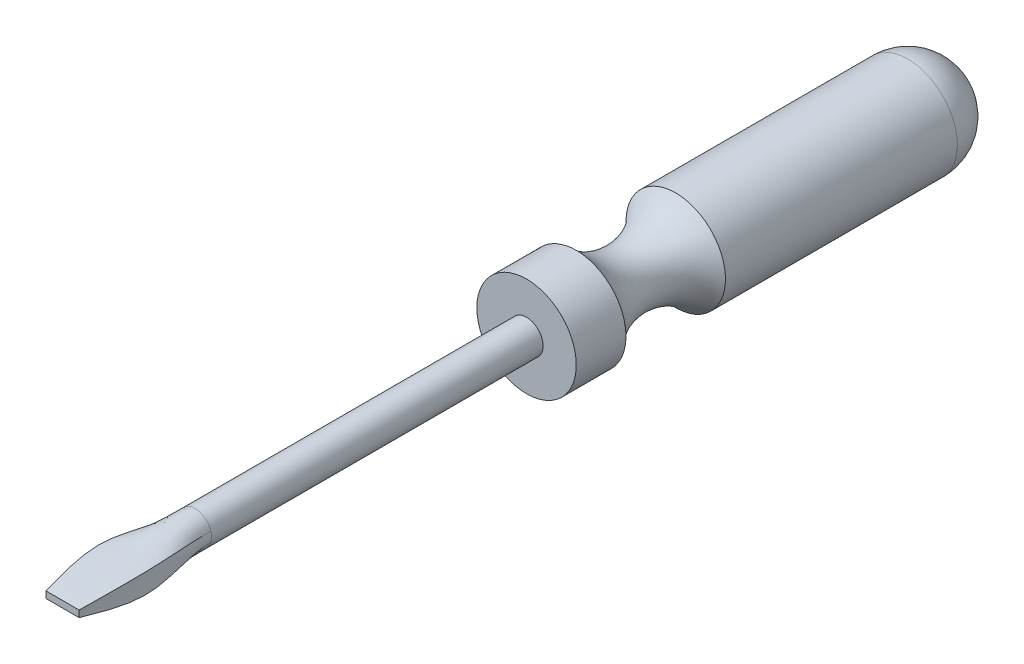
ISO-10303-21;
HEADER;
FILE_DESCRIPTION(('STEP AP214'),'2;1');
FILE_NAME('part.step','',(''),(''),'','','');
FILE_SCHEMA(('AUTOMOTIVE_DESIGN { 1 0 10303 214 1 1 1 1 }'));
ENDSEC;
DATA;
#1=APPLICATION_CONTEXT('core data for automotive mechanical design processes');
#2=APPLICATION_PROTOCOL_DEFINITION('international standard','automotive_design',2000,#1);
#3=PRODUCT_CONTEXT('',#1,'mechanical');
#4=PRODUCT('Part','Part','',(#3));
#5=PRODUCT_RELATED_PRODUCT_CATEGORY('part','',(#4));
#6=PRODUCT_DEFINITION_FORMATION('','',#4);
#7=PRODUCT_DEFINITION_CONTEXT('part definition',#1,'design');
#8=PRODUCT_DEFINITION('design','',#6,#7);
#9=PRODUCT_DEFINITION_SHAPE('','',#8);
#10=(LENGTH_UNIT() NAMED_UNIT(*) SI_UNIT(.MILLI.,.METRE.));
#11=(NAMED_UNIT(*) PLANE_ANGLE_UNIT() SI_UNIT($,.RADIAN.));
#12=(NAMED_UNIT(*) SI_UNIT($,.STERADIAN.) SOLID_ANGLE_UNIT());
#13=UNCERTAINTY_MEASURE_WITH_UNIT(LENGTH_MEASURE(1.E-05),#10,'distance_accuracy_value','');
#14=(GEOMETRIC_REPRESENTATION_CONTEXT(3) GLOBAL_UNCERTAINTY_ASSIGNED_CONTEXT((#13)) GLOBAL_UNIT_ASSIGNED_CONTEXT((#10,
#11,#12)) REPRESENTATION_CONTEXT('',''));
#15=CARTESIAN_POINT('',(0.,0.,0.));
#16=DIRECTION('',(0.,0.,1.));
#17=DIRECTION('',(1.,0.,0.));
#18=AXIS2_PLACEMENT_3D('',#15,#16,#17);
#19=CARTESIAN_POINT('',(0.,0.,0.));
#20=DIRECTION('',(0.,0.,-1.));
#21=DIRECTION('',(-1.,0.,0.));
#22=AXIS2_PLACEMENT_3D('',#19,#20,#21);
#23=PLANE('',#22);
#24=CARTESIAN_POINT('',(0.,0.,0.));
#25=DIRECTION('',(0.,0.,-1.));
#26=DIRECTION('',(-1.,0.,0.));
#27=AXIS2_PLACEMENT_3D('',#24,#25,#26);
#28=CIRCLE('',#27,19.05);
#29=CARTESIAN_POINT('',(-19.05,0.,0.));
#30=VERTEX_POINT('',#29);
#31=EDGE_CURVE('E60',#30,#30,#28,.T.);
#32=ORIENTED_EDGE('',*,*,#31,.F.);
#33=EDGE_LOOP('',(#32));
#34=FACE_BOUND('',#33,.T.);
#35=CARTESIAN_POINT('',(0.,0.,0.));
#36=DIRECTION('',(0.,0.,-1.));
#37=DIRECTION('',(-1.,0.,0.));
#38=AXIS2_PLACEMENT_3D('',#35,#36,#37);
#39=CIRCLE('',#38,6.35);
#40=CARTESIAN_POINT('',(-6.35,0.,0.));
#41=VERTEX_POINT('',#40);
#42=EDGE_CURVE('E12',#41,#41,#39,.F.);
#43=ORIENTED_EDGE('',*,*,#42,.F.);
#44=EDGE_LOOP('',(#43));
#45=FACE_BOUND('',#44,.T.);
#46=ADVANCED_FACE('F50',(#34,#45),#23,.F.);
#47=CARTESIAN_POINT('',(0.,0.,0.));
#48=DIRECTION('',(0.,0.,-1.));
#49=DIRECTION('',(-1.,0.,0.));
#50=AXIS2_PLACEMENT_3D('',#47,#48,#49);
#51=CYLINDRICAL_SURFACE('',#50,19.05);
#52=CARTESIAN_POINT('',(0.,0.,-19.05));
#53=DIRECTION('',(0.,0.,-1.));
#54=DIRECTION('',(-1.,0.,0.));
#55=AXIS2_PLACEMENT_3D('',#52,#53,#54);
#56=CIRCLE('',#55,19.05);
#57=CARTESIAN_POINT('',(-19.05,0.,-19.05));
#58=VERTEX_POINT('',#57);
#59=EDGE_CURVE('E165',#58,#58,#56,.T.);
#60=ORIENTED_EDGE('',*,*,#59,.F.);
#61=EDGE_LOOP('',(#60));
#62=FACE_BOUND('',#61,.T.);
#63=ORIENTED_EDGE('',*,*,#31,.T.);
#64=EDGE_LOOP('',(#63));
#65=FACE_BOUND('',#64,.T.);
#66=ADVANCED_FACE('F175',(#62,#65),#51,.T.);
#67=CARTESIAN_POINT('',(0.,0.,-38.1));
#68=DIRECTION('',(0.,0.,-1.));
#69=DIRECTION('',(-1.,0.,0.));
#70=AXIS2_PLACEMENT_3D('',#67,#68,#69);
#71=TOROIDAL_SURFACE('',#70,35.8505208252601,25.4);
#72=CARTESIAN_POINT('',(0.,0.,-57.15));
#73=DIRECTION('',(0.,0.,-1.));
#74=DIRECTION('',(-1.,0.,0.));
#75=AXIS2_PLACEMENT_3D('',#72,#73,#74);
#76=CIRCLE('',#75,19.05);
#77=CARTESIAN_POINT('',(-19.05,0.,-57.15));
#78=VERTEX_POINT('',#77);
#79=EDGE_CURVE('E160',#78,#78,#76,.T.);
#80=ORIENTED_EDGE('',*,*,#79,.F.);
#81=EDGE_LOOP('',(#80));
#82=FACE_BOUND('',#81,.T.);
#83=ORIENTED_EDGE('',*,*,#59,.T.);
#84=EDGE_LOOP('',(#83));
#85=FACE_BOUND('',#84,.T.);
#86=ADVANCED_FACE('F172',(#82,#85),#71,.F.);
#87=CARTESIAN_POINT('',(0.,0.,0.));
#88=DIRECTION('',(0.,0.,-1.));
#89=DIRECTION('',(-1.,0.,0.));
#90=AXIS2_PLACEMENT_3D('',#87,#88,#89);
#91=CYLINDRICAL_SURFACE('',#90,19.05);
#92=CARTESIAN_POINT('',(0.,0.,-146.05));
#93=DIRECTION('',(0.,0.,-1.));
#94=DIRECTION('',(-1.,0.,0.));
#95=AXIS2_PLACEMENT_3D('',#92,#93,#94);
#96=CIRCLE('',#95,19.05);
#97=CARTESIAN_POINT('',(-19.05,0.,-146.05));
#98=VERTEX_POINT('',#97);
#99=EDGE_CURVE('E121',#98,#98,#96,.T.);
#100=ORIENTED_EDGE('',*,*,#99,.F.);
#101=EDGE_LOOP('',(#100));
#102=FACE_BOUND('',#101,.T.);
#103=ORIENTED_EDGE('',*,*,#79,.T.);
#104=EDGE_LOOP('',(#103));
#105=FACE_BOUND('',#104,.T.);
#106=ADVANCED_FACE('F170',(#102,#105),#91,.T.);
#107=CARTESIAN_POINT('',(0.,0.,-146.05));
#108=DIRECTION('',(0.,0.,-1.));
#109=DIRECTION('',(1.,0.,0.));
#110=AXIS2_PLACEMENT_3D('',#107,#108,#109);
#111=SPHERICAL_SURFACE('',#110,19.05);
#112=ORIENTED_EDGE('',*,*,#99,.T.);
#113=EDGE_LOOP('',(#112));
#114=FACE_BOUND('',#113,.T.);
#115=ADVANCED_FACE('F189',(#114),#111,.T.);
#116=CARTESIAN_POINT('',(0.,0.,144.960512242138));
#117=DIRECTION('',(0.,0.,-1.));
#118=DIRECTION('',(-1.,0.,0.));
#119=AXIS2_PLACEMENT_3D('',#116,#117,#118);
#120=CYLINDRICAL_SURFACE('',#119,6.35);
#121=ORIENTED_EDGE('',*,*,#42,.T.);
#122=EDGE_LOOP('',(#121));
#123=FACE_BOUND('',#122,.T.);
#124=CARTESIAN_POINT('',(0.,0.,127.));
#125=DIRECTION('',(0.,0.,1.));
#126=DIRECTION('',(1.,0.,0.));
#127=AXIS2_PLACEMENT_3D('',#124,#125,#126);
#128=CIRCLE('',#127,6.35);
#129=CARTESIAN_POINT('',(6.06423657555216,1.88349004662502,127.));
#130=VERTEX_POINT('',#129);
#131=CARTESIAN_POINT('',(-6.06423657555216,1.88349004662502,127.));
#132=VERTEX_POINT('',#131);
#133=EDGE_CURVE('E101',#130,#132,#128,.T.);
#134=ORIENTED_EDGE('',*,*,#133,.F.);
#135=CARTESIAN_POINT('',(0.,0.,127.));
#136=DIRECTION('',(0.,0.,1.));
#137=DIRECTION('',(1.,0.,0.));
#138=AXIS2_PLACEMENT_3D('',#135,#136,#137);
#139=CIRCLE('',#138,6.35);
#140=CARTESIAN_POINT('',(6.06423657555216,-1.88349004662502,127.));
#141=VERTEX_POINT('',#140);
#142=EDGE_CURVE('E68',#141,#130,#139,.T.);
#143=ORIENTED_EDGE('',*,*,#142,.F.);
#144=CARTESIAN_POINT('',(-6.06423657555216,-1.88349004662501,127.));
#145=VERTEX_POINT('',#144);
#146=EDGE_CURVE('E73',#145,#141,#139,.T.);
#147=ORIENTED_EDGE('',*,*,#146,.F.);
#148=EDGE_CURVE('E109',#132,#145,#139,.T.);
#149=ORIENTED_EDGE('',*,*,#148,.F.);
#150=EDGE_LOOP('',(#134,#143,#147,#149));
#151=FACE_BOUND('',#150,.T.);
#152=ADVANCED_FACE('F187',(#123,#151),#120,.T.);
#153=CARTESIAN_POINT('',(-6.35,1.27,177.8));
#154=DIRECTION('',(0.,0.,-1.));
#155=DIRECTION('',(-1.,0.,0.));
#156=AXIS2_PLACEMENT_3D('',#153,#154,#155);
#157=PLANE('',#156);
#158=DIRECTION('',(0.,-1.,0.));
#159=VECTOR('',#158,1.);
#160=CARTESIAN_POINT('',(-6.35,-1.27,177.8));
#161=LINE('',#160,#159);
#162=CARTESIAN_POINT('',(-6.35,1.27,177.8));
#163=VERTEX_POINT('',#162);
#164=CARTESIAN_POINT('',(-6.35,-1.27,177.8));
#165=VERTEX_POINT('',#164);
#166=EDGE_CURVE('E108',#163,#165,#161,.T.);
#167=ORIENTED_EDGE('',*,*,#166,.T.);
#168=DIRECTION('',(1.,0.,0.));
#169=VECTOR('',#168,1.);
#170=CARTESIAN_POINT('',(-6.35,-1.27,177.8));
#171=LINE('',#170,#169);
#172=CARTESIAN_POINT('',(6.35,-1.27,177.8));
#173=VERTEX_POINT('',#172);
#174=EDGE_CURVE('E93',#165,#173,#171,.T.);
#175=ORIENTED_EDGE('',*,*,#174,.T.);
#176=DIRECTION('',(0.,1.,0.));
#177=VECTOR('',#176,1.);
#178=CARTESIAN_POINT('',(6.35,-1.27,177.8));
#179=LINE('',#178,#177);
#180=CARTESIAN_POINT('',(6.35,1.27,177.8));
#181=VERTEX_POINT('',#180);
#182=EDGE_CURVE('E102',#173,#181,#179,.T.);
#183=ORIENTED_EDGE('',*,*,#182,.T.);
#184=DIRECTION('',(-1.,0.,0.));
#185=VECTOR('',#184,1.);
#186=CARTESIAN_POINT('',(-6.35,1.27,177.8));
#187=LINE('',#186,#185);
#188=EDGE_CURVE('E113',#181,#163,#187,.T.);
#189=ORIENTED_EDGE('',*,*,#188,.T.);
#190=EDGE_LOOP('',(#167,#175,#183,#189));
#191=FACE_BOUND('',#190,.T.);
#192=ADVANCED_FACE('F111',(#191),#157,.F.);
#193=CARTESIAN_POINT('',(6.35,-1.27,177.8));
#194=CARTESIAN_POINT('',(7.84256490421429,-2.63401569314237,169.323524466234));
#195=CARTESIAN_POINT('',(10.8270084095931,-5.36141988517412,152.374471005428));
#196=CARTESIAN_POINT('',(6.06423657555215,-1.88349004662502,135.54306983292));
#197=CARTESIAN_POINT('',(6.06423657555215,-1.88349004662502,127.));
#198=CARTESIAN_POINT('',(5.92666666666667,-1.27,177.8));
#199=CARTESIAN_POINT('',(7.27999884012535,-2.58293631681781,169.043278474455));
#200=CARTESIAN_POINT('',(9.89300243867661,-5.11794389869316,152.135866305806));
#201=CARTESIAN_POINT('',(5.93842152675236,-2.28857433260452,135.520932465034));
#202=CARTESIAN_POINT('',(5.93842152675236,-2.28857433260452,127.));
#203=CARTESIAN_POINT('',(5.08,-1.27,177.8));
#204=CARTESIAN_POINT('',(6.17870375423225,-2.49099343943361,168.538637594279));
#205=CARTESIAN_POINT('',(8.17249213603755,-4.7066976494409,151.732290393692));
#206=CARTESIAN_POINT('',(5.58464782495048,-3.12793298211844,135.476657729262));
#207=CARTESIAN_POINT('',(5.58464782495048,-3.12793298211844,127.));
#208=CARTESIAN_POINT('',(3.81,-1.27,177.8));
#209=CARTESIAN_POINT('',(4.5803944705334,-2.38372674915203,167.943937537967));
#210=CARTESIAN_POINT('',(5.88260506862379,-4.26627761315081,151.284071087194));
#211=CARTESIAN_POINT('',(4.72398781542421,-4.33969582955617,135.466800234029));
#212=CARTESIAN_POINT('',(4.72398781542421,-4.33969582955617,127.));
#213=CARTESIAN_POINT('',(2.54,-1.27,177.8));
#214=CARTESIAN_POINT('',(3.02805662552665,-2.30710768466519,167.516886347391));
#215=CARTESIAN_POINT('',(3.81285769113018,-3.97478961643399,150.981512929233));
#216=CARTESIAN_POINT('',(3.46583235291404,-5.41401012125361,135.480703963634));
#217=CARTESIAN_POINT('',(3.46583235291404,-5.41401012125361,127.));
#218=CARTESIAN_POINT('',(1.27,-1.27,177.8));
#219=CARTESIAN_POINT('',(1.50636640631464,-2.26113624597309,167.259529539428));
#220=CARTESIAN_POINT('',(1.8753351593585,-3.80830325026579,150.805819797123));
#221=CARTESIAN_POINT('',(1.84411637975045,-6.16889967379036,135.502451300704));
#222=CARTESIAN_POINT('',(1.84411637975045,-6.16889967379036,127.));
#223=CARTESIAN_POINT('',(0.,-1.27,177.8));
#224=CARTESIAN_POINT('',(0.,-2.24581243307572,167.173579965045));
#225=CARTESIAN_POINT('',(0.,-3.75413355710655,150.748237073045));
#226=CARTESIAN_POINT('',(0.,-6.44252934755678,135.512116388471));
#227=CARTESIAN_POINT('',(0.,-6.44252934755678,127.));
#228=CARTESIAN_POINT('',(-1.27,-1.27,177.8));
#229=CARTESIAN_POINT('',(-1.50636640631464,-2.26113624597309,167.259529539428));
#230=CARTESIAN_POINT('',(-1.8753351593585,-3.80830325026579,150.805819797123));
#231=CARTESIAN_POINT('',(-1.84411637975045,-6.16889967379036,135.502451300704));
#232=CARTESIAN_POINT('',(-1.84411637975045,-6.16889967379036,127.));
#233=CARTESIAN_POINT('',(-2.54,-1.27,177.8));
#234=CARTESIAN_POINT('',(-3.02805662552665,-2.30710768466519,167.516886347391));
#235=CARTESIAN_POINT('',(-3.81285769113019,-3.97478961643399,150.981512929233));
#236=CARTESIAN_POINT('',(-3.46583235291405,-5.4140101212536,135.480703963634));
#237=CARTESIAN_POINT('',(-3.46583235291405,-5.4140101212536,127.));
#238=CARTESIAN_POINT('',(-3.81,-1.27,177.8));
#239=CARTESIAN_POINT('',(-4.5803944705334,-2.38372674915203,167.943937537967));
#240=CARTESIAN_POINT('',(-5.8826050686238,-4.26627761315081,151.284071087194));
#241=CARTESIAN_POINT('',(-4.72398781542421,-4.33969582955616,135.466800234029));
#242=CARTESIAN_POINT('',(-4.72398781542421,-4.33969582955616,127.));
#243=CARTESIAN_POINT('',(-5.08,-1.27,177.8));
#244=CARTESIAN_POINT('',(-6.17870375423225,-2.49099343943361,168.538637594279));
#245=CARTESIAN_POINT('',(-8.17249213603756,-4.7066976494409,151.732290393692));
#246=CARTESIAN_POINT('',(-5.58464782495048,-3.12793298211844,135.476657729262));
#247=CARTESIAN_POINT('',(-5.58464782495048,-3.12793298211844,127.));
#248=CARTESIAN_POINT('',(-5.92666666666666,-1.27,177.8));
#249=CARTESIAN_POINT('',(-7.27999884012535,-2.58293631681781,169.043278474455));
#250=CARTESIAN_POINT('',(-9.89300243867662,-5.11794389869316,152.135866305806));
#251=CARTESIAN_POINT('',(-5.93842152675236,-2.28857433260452,135.520932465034));
#252=CARTESIAN_POINT('',(-5.93842152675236,-2.28857433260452,127.));
#253=CARTESIAN_POINT('',(-6.35,-1.27,177.8));
#254=CARTESIAN_POINT('',(-7.84256490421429,-2.63401569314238,169.323524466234));
#255=CARTESIAN_POINT('',(-10.8270084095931,-5.36141988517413,152.374471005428));
#256=CARTESIAN_POINT('',(-6.06423657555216,-1.88349004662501,135.54306983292));
#257=CARTESIAN_POINT('',(-6.06423657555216,-1.88349004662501,127.));
#258=(BOUNDED_SURFACE() B_SPLINE_SURFACE(3,3,((#193,#194,#195,#196,#197),(#198,#199,#200,#201,
#202),(#203,#204,#205,#206,#207),(#208,#209,#210,#211,#212),(#213,#214,#215,#216,#217),(#218,
#219,#220,#221,#222),(#223,#224,#225,#226,#227),(#228,#229,#230,#231,#232),(#233,#234,#235,#236,
#237),(#238,#239,#240,#241,#242),(#243,#244,#245,#246,#247),(#248,#249,#250,#251,#252),(#253,
#254,#255,#256,#257)),.UNSPECIFIED.,.F.,.F.,.F.) B_SPLINE_SURFACE_WITH_KNOTS((4,1,1,1,1,1,1,1,1,
1,4),(4,1,4),(0.,0.1,0.2,0.3,0.4,0.5,0.6,0.7,0.8,0.9,1.),(0.,0.50011498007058,1.),
.UNSPECIFIED.) GEOMETRIC_REPRESENTATION_ITEM() RATIONAL_B_SPLINE_SURFACE(((1.,1.,1.,1.,1.),(1.,
1.,1.02345703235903,0.953107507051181,0.953107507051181),(1.,1.,1.06567969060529,
0.868701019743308,0.868701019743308),(1.,1.,1.11493945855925,0.770226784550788,
0.770226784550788),(1.,1.,1.1501250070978,0.69988804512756,0.69988804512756),(1.,1.,
1.17123633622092,0.657684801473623,0.657684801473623),(1.,1.,1.17827344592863,0.643617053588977,
0.643617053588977),(1.,1.,1.17123633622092,0.657684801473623,0.657684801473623),(1.,1.,
1.1501250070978,0.69988804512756,0.69988804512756),(1.,1.,1.11493945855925,0.770226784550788,
0.770226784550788),(1.,1.,1.06567969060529,0.868701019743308,0.868701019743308),(1.,1.,
1.02345703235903,0.953107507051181,0.953107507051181),(1.,1.,1.,1.,1.))) REPRESENTATION_ITEM('') SURFACE());
#259=CARTESIAN_POINT('',(-6.35,-1.27,177.8));
#260=CARTESIAN_POINT('',(-7.84256490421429,-2.63401569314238,169.323524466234));
#261=CARTESIAN_POINT('',(-10.8270084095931,-5.36141988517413,152.374471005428));
#262=CARTESIAN_POINT('',(-6.06423657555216,-1.88349004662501,135.54306983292));
#263=CARTESIAN_POINT('',(-6.06423657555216,-1.88349004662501,127.));
#264=B_SPLINE_CURVE_WITH_KNOTS('',3,(#259,#260,#261,#262,#263),.UNSPECIFIED.,.F.,.F.,(4,1,4),
(0.,0.50011498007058,1.),.UNSPECIFIED.);
#265=EDGE_CURVE('E96',#165,#145,#264,.T.);
#266=CARTESIAN_POINT('',(6.35,-1.27,177.8));
#267=CARTESIAN_POINT('',(7.84256490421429,-2.63401569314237,169.323524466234));
#268=CARTESIAN_POINT('',(10.8270084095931,-5.36141988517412,152.374471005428));
#269=CARTESIAN_POINT('',(6.06423657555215,-1.88349004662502,135.54306983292));
#270=CARTESIAN_POINT('',(6.06423657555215,-1.88349004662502,127.));
#271=B_SPLINE_CURVE_WITH_KNOTS('',3,(#266,#267,#268,#269,#270),.UNSPECIFIED.,.F.,.F.,(4,1,4),
(0.,0.50011498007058,1.),.UNSPECIFIED.);
#272=EDGE_CURVE('E97',#141,#173,#271,.F.);
#273=ORIENTED_EDGE('',*,*,#174,.F.);
#274=ORIENTED_EDGE('',*,*,#265,.T.);
#275=ORIENTED_EDGE('',*,*,#146,.T.);
#276=ORIENTED_EDGE('',*,*,#272,.T.);
#277=EDGE_LOOP('',(#273,#274,#275,#276));
#278=FACE_BOUND('',#277,.T.);
#279=ADVANCED_FACE('F95',(#278),#258,.T.);
#280=CARTESIAN_POINT('',(-6.35,-1.27,177.8));
#281=CARTESIAN_POINT('',(-7.84256490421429,-2.63401569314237,169.323524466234));
#282=CARTESIAN_POINT('',(-10.8270084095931,-5.36141988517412,152.374471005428));
#283=CARTESIAN_POINT('',(-6.06423657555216,-1.88349004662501,135.54306983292));
#284=CARTESIAN_POINT('',(-6.06423657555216,-1.88349004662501,127.));
#285=CARTESIAN_POINT('',(-6.35,-1.18533333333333,177.8));
#286=CARTESIAN_POINT('',(-7.8371182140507,-2.45790628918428,169.306031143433));
#287=CARTESIAN_POINT('',(-10.8039864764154,-4.99674703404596,152.360178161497));
#288=CARTESIAN_POINT('',(-6.10159310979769,-1.76321393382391,135.538652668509));
#289=CARTESIAN_POINT('',(-6.10159310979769,-1.76321393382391,127.));
#290=CARTESIAN_POINT('',(-6.35,-1.016,177.8));
#291=CARTESIAN_POINT('',(-7.82731417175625,-2.10599249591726,169.274658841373));
#292=CARTESIAN_POINT('',(-10.7627204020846,-4.27179502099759,152.334904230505));
#293=CARTESIAN_POINT('',(-6.16940451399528,-1.51955691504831,135.529818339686));
#294=CARTESIAN_POINT('',(-6.16940451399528,-1.51955691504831,127.));
#295=CARTESIAN_POINT('',(-6.35,-0.762,177.8));
#296=CARTESIAN_POINT('',(-7.81587612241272,-1.57880808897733,169.237907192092));
#297=CARTESIAN_POINT('',(-10.7148563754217,-3.19416322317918,152.305140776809));
#298=CARTESIAN_POINT('',(-6.24945729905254,-1.14695505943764,135.520458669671));
#299=CARTESIAN_POINT('',(-6.24945729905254,-1.14695505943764,127.));
#300=CARTESIAN_POINT('',(-6.35,-0.508,177.8));
#301=CARTESIAN_POINT('',(-7.80770608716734,-1.05221192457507,169.211653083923));
#302=CARTESIAN_POINT('',(-10.6808507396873,-2.1248558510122,152.283986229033));
#303=CARTESIAN_POINT('',(-6.30726752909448,-0.768145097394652,135.513720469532));
#304=CARTESIAN_POINT('',(-6.30726752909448,-0.768145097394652,127.));
#305=CARTESIAN_POINT('',(-6.35,-0.254,177.8));
#306=CARTESIAN_POINT('',(-7.80280406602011,-0.526007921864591,169.195883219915));
#307=CARTESIAN_POINT('',(-10.66052005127,-1.06105693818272,152.27128709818));
#308=CARTESIAN_POINT('',(-6.34220901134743,-0.38513281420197,135.50977222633));
#309=CARTESIAN_POINT('',(-6.34220901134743,-0.38513281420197,127.));
#310=CARTESIAN_POINT('',(-6.35,0.,177.8));
#311=CARTESIAN_POINT('',(-7.80117005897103,0.,169.190625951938));
#312=CARTESIAN_POINT('',(-10.6537552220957,0.,152.267059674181));
#313=CARTESIAN_POINT('',(-6.35389908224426,0.,135.508455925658));
#314=CARTESIAN_POINT('',(-6.35389908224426,0.,127.));
#315=CARTESIAN_POINT('',(-6.35,0.254,177.8));
#316=CARTESIAN_POINT('',(-7.80280406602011,0.526007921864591,169.195883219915));
#317=CARTESIAN_POINT('',(-10.66052005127,1.06105693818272,152.27128709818));
#318=CARTESIAN_POINT('',(-6.34220901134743,0.385132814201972,135.50977222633));
#319=CARTESIAN_POINT('',(-6.34220901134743,0.385132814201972,127.));
#320=CARTESIAN_POINT('',(-6.35,0.508,177.8));
#321=CARTESIAN_POINT('',(-7.80770608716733,1.05221192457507,169.211653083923));
#322=CARTESIAN_POINT('',(-10.6808507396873,2.1248558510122,152.283986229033));
#323=CARTESIAN_POINT('',(-6.30726752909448,0.768145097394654,135.513720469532));
#324=CARTESIAN_POINT('',(-6.30726752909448,0.768145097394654,127.));
#325=CARTESIAN_POINT('',(-6.35,0.762,177.8));
#326=CARTESIAN_POINT('',(-7.81587612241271,1.57880808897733,169.237907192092));
#327=CARTESIAN_POINT('',(-10.7148563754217,3.19416322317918,152.305140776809));
#328=CARTESIAN_POINT('',(-6.24945729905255,1.14695505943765,135.520458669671));
#329=CARTESIAN_POINT('',(-6.24945729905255,1.14695505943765,127.));
#330=CARTESIAN_POINT('',(-6.35,1.016,177.8));
#331=CARTESIAN_POINT('',(-7.82731417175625,2.10599249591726,169.274658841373));
#332=CARTESIAN_POINT('',(-10.7627204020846,4.27179502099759,152.334904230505));
#333=CARTESIAN_POINT('',(-6.16940451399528,1.51955691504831,135.529818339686));
#334=CARTESIAN_POINT('',(-6.16940451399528,1.51955691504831,127.));
#335=CARTESIAN_POINT('',(-6.35,1.18533333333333,177.8));
#336=CARTESIAN_POINT('',(-7.8371182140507,2.45790628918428,169.306031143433));
#337=CARTESIAN_POINT('',(-10.8039864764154,4.99674703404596,152.360178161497));
#338=CARTESIAN_POINT('',(-6.10159310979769,1.76321393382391,135.538652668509));
#339=CARTESIAN_POINT('',(-6.10159310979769,1.76321393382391,127.));
#340=CARTESIAN_POINT('',(-6.35,1.27,177.8));
#341=CARTESIAN_POINT('',(-7.84256490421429,2.63401569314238,169.323524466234));
#342=CARTESIAN_POINT('',(-10.8270084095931,5.36141988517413,152.374471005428));
#343=CARTESIAN_POINT('',(-6.06423657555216,1.88349004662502,135.54306983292));
#344=CARTESIAN_POINT('',(-6.06423657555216,1.88349004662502,127.));
#345=(BOUNDED_SURFACE() B_SPLINE_SURFACE(3,3,((#280,#281,#282,#283,#284),(#285,#286,#287,#288,
#289),(#290,#291,#292,#293,#294),(#295,#296,#297,#298,#299),(#300,#301,#302,#303,#304),(#305,
#306,#307,#308,#309),(#310,#311,#312,#313,#314),(#315,#316,#317,#318,#319),(#320,#321,#322,#323,
#324),(#325,#326,#327,#328,#329),(#330,#331,#332,#333,#334),(#335,#336,#337,#338,#339),(#340,
#341,#342,#343,#344)),.UNSPECIFIED.,.F.,.F.,.F.) B_SPLINE_SURFACE_WITH_KNOTS((4,1,1,1,1,1,1,1,1,
1,4),(4,1,4),(0.,0.1,0.2,0.3,0.4,0.5,0.6,0.7,0.8,0.9,1.),(0.,0.50011498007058,1.),
.UNSPECIFIED.) GEOMETRIC_REPRESENTATION_ITEM() RATIONAL_B_SPLINE_SURFACE(((1.,1.,1.,1.,1.),(1.,
1.,1.00150076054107,0.996999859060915,0.996999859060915),(1.,1.,1.00420212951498,
0.991599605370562,0.991599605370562),(1.,1.,1.00735372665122,0.985299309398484,
0.985299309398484),(1.,1.,1.00960486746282,0.980799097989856,0.980799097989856),(1.,1.,
1.01095555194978,0.978098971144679,0.978098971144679),(1.,1.,1.0114057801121,0.977198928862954,
0.977198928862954),(1.,1.,1.01095555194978,0.978098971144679,0.978098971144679),(1.,1.,
1.00960486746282,0.980799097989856,0.980799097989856),(1.,1.,1.00735372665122,0.985299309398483,
0.985299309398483),(1.,1.,1.00420212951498,0.991599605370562,0.991599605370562),(1.,1.,
1.00150076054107,0.996999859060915,0.996999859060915),(1.,1.,1.,1.,1.))) REPRESENTATION_ITEM('') SURFACE());
#346=CARTESIAN_POINT('',(-6.35,1.27,177.8));
#347=CARTESIAN_POINT('',(-7.84256490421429,2.63401569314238,169.323524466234));
#348=CARTESIAN_POINT('',(-10.8270084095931,5.36141988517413,152.374471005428));
#349=CARTESIAN_POINT('',(-6.06423657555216,1.88349004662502,135.54306983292));
#350=CARTESIAN_POINT('',(-6.06423657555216,1.88349004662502,127.));
#351=B_SPLINE_CURVE_WITH_KNOTS('',3,(#346,#347,#348,#349,#350),.UNSPECIFIED.,.F.,.F.,(4,1,4),
(0.,0.50011498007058,1.),.UNSPECIFIED.);
#352=EDGE_CURVE('E139',#163,#132,#351,.T.);
#353=ORIENTED_EDGE('',*,*,#166,.F.);
#354=ORIENTED_EDGE('',*,*,#352,.T.);
#355=ORIENTED_EDGE('',*,*,#148,.T.);
#356=ORIENTED_EDGE('',*,*,#265,.F.);
#357=EDGE_LOOP('',(#353,#354,#355,#356));
#358=FACE_BOUND('',#357,.T.);
#359=ADVANCED_FACE('F106',(#358),#345,.T.);
#360=CARTESIAN_POINT('',(6.35,1.27,177.8));
#361=CARTESIAN_POINT('',(7.84256490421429,2.63401569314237,169.323524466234));
#362=CARTESIAN_POINT('',(10.8270084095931,5.36141988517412,152.374471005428));
#363=CARTESIAN_POINT('',(6.06423657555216,1.88349004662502,135.54306983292));
#364=CARTESIAN_POINT('',(6.06423657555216,1.88349004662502,127.));
#365=CARTESIAN_POINT('',(6.35,1.18533333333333,177.8));
#366=CARTESIAN_POINT('',(7.83711821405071,2.45790628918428,169.306031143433));
#367=CARTESIAN_POINT('',(10.8039864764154,4.99674703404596,152.360178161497));
#368=CARTESIAN_POINT('',(6.10159310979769,1.76321393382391,135.538652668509));
#369=CARTESIAN_POINT('',(6.10159310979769,1.76321393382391,127.));
#370=CARTESIAN_POINT('',(6.35,1.016,177.8));
#371=CARTESIAN_POINT('',(7.82731417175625,2.10599249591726,169.274658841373));
#372=CARTESIAN_POINT('',(10.7627204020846,4.27179502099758,152.334904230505));
#373=CARTESIAN_POINT('',(6.16940451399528,1.51955691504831,135.529818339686));
#374=CARTESIAN_POINT('',(6.16940451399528,1.51955691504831,127.));
#375=CARTESIAN_POINT('',(6.35,0.762,177.8));
#376=CARTESIAN_POINT('',(7.81587612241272,1.57880808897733,169.237907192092));
#377=CARTESIAN_POINT('',(10.7148563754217,3.19416322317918,152.305140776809));
#378=CARTESIAN_POINT('',(6.24945729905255,1.14695505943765,135.520458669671));
#379=CARTESIAN_POINT('',(6.24945729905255,1.14695505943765,127.));
#380=CARTESIAN_POINT('',(6.35,0.508,177.8));
#381=CARTESIAN_POINT('',(7.80770608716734,1.05221192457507,169.211653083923));
#382=CARTESIAN_POINT('',(10.6808507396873,2.1248558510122,152.283986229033));
#383=CARTESIAN_POINT('',(6.30726752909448,0.768145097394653,135.513720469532));
#384=CARTESIAN_POINT('',(6.30726752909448,0.768145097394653,127.));
#385=CARTESIAN_POINT('',(6.35,0.254,177.8));
#386=CARTESIAN_POINT('',(7.80280406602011,0.526007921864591,169.195883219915));
#387=CARTESIAN_POINT('',(10.66052005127,1.06105693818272,152.27128709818));
#388=CARTESIAN_POINT('',(6.34220901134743,0.385132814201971,135.50977222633));
#389=CARTESIAN_POINT('',(6.34220901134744,0.385132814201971,127.));
#390=CARTESIAN_POINT('',(6.35,0.,177.8));
#391=CARTESIAN_POINT('',(7.80117005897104,0.,169.190625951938));
#392=CARTESIAN_POINT('',(10.6537552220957,0.,152.267059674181));
#393=CARTESIAN_POINT('',(6.35389908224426,0.,135.508455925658));
#394=CARTESIAN_POINT('',(6.35389908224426,0.,127.));
#395=CARTESIAN_POINT('',(6.35,-0.254,177.8));
#396=CARTESIAN_POINT('',(7.80280406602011,-0.526007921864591,169.195883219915));
#397=CARTESIAN_POINT('',(10.66052005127,-1.06105693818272,152.27128709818));
#398=CARTESIAN_POINT('',(6.34220901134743,-0.385132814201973,135.50977222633));
#399=CARTESIAN_POINT('',(6.34220901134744,-0.385132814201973,127.));
#400=CARTESIAN_POINT('',(6.35,-0.508,177.8));
#401=CARTESIAN_POINT('',(7.80770608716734,-1.05221192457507,169.211653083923));
#402=CARTESIAN_POINT('',(10.6808507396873,-2.1248558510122,152.283986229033));
#403=CARTESIAN_POINT('',(6.30726752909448,-0.768145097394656,135.513720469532));
#404=CARTESIAN_POINT('',(6.30726752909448,-0.768145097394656,127.));
#405=CARTESIAN_POINT('',(6.35,-0.762,177.8));
#406=CARTESIAN_POINT('',(7.81587612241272,-1.57880808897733,169.237907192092));
#407=CARTESIAN_POINT('',(10.7148563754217,-3.19416322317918,152.305140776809));
#408=CARTESIAN_POINT('',(6.24945729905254,-1.14695505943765,135.520458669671));
#409=CARTESIAN_POINT('',(6.24945729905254,-1.14695505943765,127.));
#410=CARTESIAN_POINT('',(6.35,-1.016,177.8));
#411=CARTESIAN_POINT('',(7.82731417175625,-2.10599249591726,169.274658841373));
#412=CARTESIAN_POINT('',(10.7627204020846,-4.27179502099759,152.334904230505));
#413=CARTESIAN_POINT('',(6.16940451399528,-1.51955691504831,135.529818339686));
#414=CARTESIAN_POINT('',(6.16940451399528,-1.51955691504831,127.));
#415=CARTESIAN_POINT('',(6.35,-1.18533333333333,177.8));
#416=CARTESIAN_POINT('',(7.83711821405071,-2.45790628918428,169.306031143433));
#417=CARTESIAN_POINT('',(10.8039864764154,-4.99674703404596,152.360178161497));
#418=CARTESIAN_POINT('',(6.10159310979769,-1.76321393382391,135.538652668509));
#419=CARTESIAN_POINT('',(6.10159310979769,-1.76321393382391,127.));
#420=CARTESIAN_POINT('',(6.35,-1.27,177.8));
#421=CARTESIAN_POINT('',(7.84256490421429,-2.63401569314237,169.323524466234));
#422=CARTESIAN_POINT('',(10.8270084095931,-5.36141988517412,152.374471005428));
#423=CARTESIAN_POINT('',(6.06423657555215,-1.88349004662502,135.54306983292));
#424=CARTESIAN_POINT('',(6.06423657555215,-1.88349004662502,127.));
#425=(BOUNDED_SURFACE() B_SPLINE_SURFACE(3,3,((#360,#361,#362,#363,#364),(#365,#366,#367,#368,
#369),(#370,#371,#372,#373,#374),(#375,#376,#377,#378,#379),(#380,#381,#382,#383,#384),(#385,
#386,#387,#388,#389),(#390,#391,#392,#393,#394),(#395,#396,#397,#398,#399),(#400,#401,#402,#403,
#404),(#405,#406,#407,#408,#409),(#410,#411,#412,#413,#414),(#415,#416,#417,#418,#419),(#420,
#421,#422,#423,#424)),.UNSPECIFIED.,.F.,.F.,.F.) B_SPLINE_SURFACE_WITH_KNOTS((4,1,1,1,1,1,1,1,1,
1,4),(4,1,4),(0.,0.1,0.2,0.3,0.4,0.5,0.6,0.7,0.8,0.9,1.),(0.,0.50011498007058,1.),
.UNSPECIFIED.) GEOMETRIC_REPRESENTATION_ITEM() RATIONAL_B_SPLINE_SURFACE(((1.,1.,1.,1.,1.),(1.,
1.,1.00150076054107,0.996999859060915,0.996999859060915),(1.,1.,1.00420212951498,
0.991599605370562,0.991599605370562),(1.,1.,1.00735372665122,0.985299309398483,
0.985299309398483),(1.,1.,1.00960486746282,0.980799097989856,0.980799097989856),(1.,1.,
1.01095555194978,0.978098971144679,0.978098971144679),(1.,1.,1.0114057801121,0.977198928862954,
0.977198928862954),(1.,1.,1.01095555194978,0.978098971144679,0.978098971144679),(1.,1.,
1.00960486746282,0.980799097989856,0.980799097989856),(1.,1.,1.00735372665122,0.985299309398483,
0.985299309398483),(1.,1.,1.00420212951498,0.991599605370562,0.991599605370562),(1.,1.,
1.00150076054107,0.996999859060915,0.996999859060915),(1.,1.,1.,1.,1.))) REPRESENTATION_ITEM('') SURFACE());
#426=CARTESIAN_POINT('',(6.35,1.27,177.8));
#427=CARTESIAN_POINT('',(7.84256490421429,2.63401569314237,169.323524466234));
#428=CARTESIAN_POINT('',(10.8270084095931,5.36141988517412,152.374471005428));
#429=CARTESIAN_POINT('',(6.06423657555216,1.88349004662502,135.54306983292));
#430=CARTESIAN_POINT('',(6.06423657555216,1.88349004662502,127.));
#431=B_SPLINE_CURVE_WITH_KNOTS('',3,(#426,#427,#428,#429,#430),.UNSPECIFIED.,.F.,.F.,(4,1,4),
(0.,0.50011498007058,1.),.UNSPECIFIED.);
#432=EDGE_CURVE('E143',#130,#181,#431,.F.);
#433=ORIENTED_EDGE('',*,*,#182,.F.);
#434=ORIENTED_EDGE('',*,*,#272,.F.);
#435=ORIENTED_EDGE('',*,*,#142,.T.);
#436=ORIENTED_EDGE('',*,*,#432,.T.);
#437=EDGE_LOOP('',(#433,#434,#435,#436));
#438=FACE_BOUND('',#437,.T.);
#439=ADVANCED_FACE('F154',(#438),#425,.T.);
#440=CARTESIAN_POINT('',(-6.35,1.27,177.8));
#441=CARTESIAN_POINT('',(-7.84256490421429,2.63401569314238,169.323524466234));
#442=CARTESIAN_POINT('',(-10.8270084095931,5.36141988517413,152.374471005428));
#443=CARTESIAN_POINT('',(-6.06423657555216,1.88349004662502,135.54306983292));
#444=CARTESIAN_POINT('',(-6.06423657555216,1.88349004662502,127.));
#445=CARTESIAN_POINT('',(-5.92666666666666,1.27,177.8));
#446=CARTESIAN_POINT('',(-7.27999884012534,2.58293631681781,169.043278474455));
#447=CARTESIAN_POINT('',(-9.89300243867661,5.11794389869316,152.135866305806));
#448=CARTESIAN_POINT('',(-5.93842152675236,2.28857433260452,135.520932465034));
#449=CARTESIAN_POINT('',(-5.93842152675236,2.28857433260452,127.));
#450=CARTESIAN_POINT('',(-5.08,1.27,177.8));
#451=CARTESIAN_POINT('',(-6.17870375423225,2.49099343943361,168.538637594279));
#452=CARTESIAN_POINT('',(-8.17249213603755,4.7066976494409,151.732290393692));
#453=CARTESIAN_POINT('',(-5.58464782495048,3.12793298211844,135.476657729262));
#454=CARTESIAN_POINT('',(-5.58464782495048,3.12793298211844,127.));
#455=CARTESIAN_POINT('',(-3.81,1.27,177.8));
#456=CARTESIAN_POINT('',(-4.5803944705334,2.38372674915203,167.943937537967));
#457=CARTESIAN_POINT('',(-5.88260506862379,4.26627761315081,151.284071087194));
#458=CARTESIAN_POINT('',(-4.72398781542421,4.33969582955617,135.466800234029));
#459=CARTESIAN_POINT('',(-4.72398781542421,4.33969582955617,127.));
#460=CARTESIAN_POINT('',(-2.54,1.27,177.8));
#461=CARTESIAN_POINT('',(-3.02805662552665,2.30710768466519,167.516886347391));
#462=CARTESIAN_POINT('',(-3.81285769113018,3.97478961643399,150.981512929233));
#463=CARTESIAN_POINT('',(-3.46583235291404,5.41401012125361,135.480703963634));
#464=CARTESIAN_POINT('',(-3.46583235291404,5.41401012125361,127.));
#465=CARTESIAN_POINT('',(-1.27,1.27,177.8));
#466=CARTESIAN_POINT('',(-1.50636640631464,2.26113624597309,167.259529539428));
#467=CARTESIAN_POINT('',(-1.87533515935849,3.80830325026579,150.805819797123));
#468=CARTESIAN_POINT('',(-1.84411637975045,6.16889967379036,135.502451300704));
#469=CARTESIAN_POINT('',(-1.84411637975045,6.16889967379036,127.));
#470=CARTESIAN_POINT('',(0.,1.27,177.8));
#471=CARTESIAN_POINT('',(0.,2.24581243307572,167.173579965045));
#472=CARTESIAN_POINT('',(0.,3.75413355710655,150.748237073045));
#473=CARTESIAN_POINT('',(0.,6.44252934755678,135.512116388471));
#474=CARTESIAN_POINT('',(0.,6.44252934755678,127.));
#475=CARTESIAN_POINT('',(1.27,1.27,177.8));
#476=CARTESIAN_POINT('',(1.50636640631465,2.26113624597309,167.259529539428));
#477=CARTESIAN_POINT('',(1.87533515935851,3.80830325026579,150.805819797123));
#478=CARTESIAN_POINT('',(1.84411637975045,6.16889967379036,135.502451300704));
#479=CARTESIAN_POINT('',(1.84411637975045,6.16889967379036,127.));
#480=CARTESIAN_POINT('',(2.54,1.27,177.8));
#481=CARTESIAN_POINT('',(3.02805662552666,2.30710768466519,167.516886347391));
#482=CARTESIAN_POINT('',(3.8128576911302,3.97478961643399,150.981512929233));
#483=CARTESIAN_POINT('',(3.46583235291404,5.4140101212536,135.480703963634));
#484=CARTESIAN_POINT('',(3.46583235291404,5.4140101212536,127.));
#485=CARTESIAN_POINT('',(3.81,1.27,177.8));
#486=CARTESIAN_POINT('',(4.58039447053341,2.38372674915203,167.943937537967));
#487=CARTESIAN_POINT('',(5.88260506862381,4.26627761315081,151.284071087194));
#488=CARTESIAN_POINT('',(4.72398781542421,4.33969582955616,135.466800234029));
#489=CARTESIAN_POINT('',(4.72398781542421,4.33969582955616,127.));
#490=CARTESIAN_POINT('',(5.08,1.27,177.8));
#491=CARTESIAN_POINT('',(6.17870375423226,2.49099343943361,168.538637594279));
#492=CARTESIAN_POINT('',(8.17249213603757,4.7066976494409,151.732290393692));
#493=CARTESIAN_POINT('',(5.58464782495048,3.12793298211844,135.476657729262));
#494=CARTESIAN_POINT('',(5.58464782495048,3.12793298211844,127.));
#495=CARTESIAN_POINT('',(5.92666666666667,1.27,177.8));
#496=CARTESIAN_POINT('',(7.27999884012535,2.58293631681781,169.043278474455));
#497=CARTESIAN_POINT('',(9.89300243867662,5.11794389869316,152.135866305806));
#498=CARTESIAN_POINT('',(5.93842152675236,2.28857433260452,135.520932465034));
#499=CARTESIAN_POINT('',(5.93842152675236,2.28857433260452,127.));
#500=CARTESIAN_POINT('',(6.35,1.27,177.8));
#501=CARTESIAN_POINT('',(7.84256490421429,2.63401569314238,169.323524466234));
#502=CARTESIAN_POINT('',(10.8270084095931,5.36141988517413,152.374471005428));
#503=CARTESIAN_POINT('',(6.06423657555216,1.88349004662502,135.54306983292));
#504=CARTESIAN_POINT('',(6.06423657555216,1.88349004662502,127.));
#505=(BOUNDED_SURFACE() B_SPLINE_SURFACE(3,3,((#440,#441,#442,#443,#444),(#445,#446,#447,#448,
#449),(#450,#451,#452,#453,#454),(#455,#456,#457,#458,#459),(#460,#461,#462,#463,#464),(#465,
#466,#467,#468,#469),(#470,#471,#472,#473,#474),(#475,#476,#477,#478,#479),(#480,#481,#482,#483,
#484),(#485,#486,#487,#488,#489),(#490,#491,#492,#493,#494),(#495,#496,#497,#498,#499),(#500,
#501,#502,#503,#504)),.UNSPECIFIED.,.F.,.F.,.F.) B_SPLINE_SURFACE_WITH_KNOTS((4,1,1,1,1,1,1,1,1,
1,4),(4,1,4),(0.,0.1,0.2,0.3,0.4,0.5,0.6,0.7,0.8,0.9,1.),(0.,0.50011498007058,1.),
.UNSPECIFIED.) GEOMETRIC_REPRESENTATION_ITEM() RATIONAL_B_SPLINE_SURFACE(((1.,1.,1.,1.,1.),(1.,
1.,1.02345703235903,0.953107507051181,0.953107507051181),(1.,1.,1.06567969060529,
0.868701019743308,0.868701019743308),(1.,1.,1.11493945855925,0.770226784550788,
0.770226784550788),(1.,1.,1.1501250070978,0.69988804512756,0.69988804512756),(1.,1.,
1.17123633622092,0.657684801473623,0.657684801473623),(1.,1.,1.17827344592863,0.643617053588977,
0.643617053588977),(1.,1.,1.17123633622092,0.657684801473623,0.657684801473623),(1.,1.,
1.1501250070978,0.69988804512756,0.69988804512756),(1.,1.,1.11493945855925,0.770226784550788,
0.770226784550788),(1.,1.,1.06567969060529,0.868701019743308,0.868701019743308),(1.,1.,
1.02345703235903,0.953107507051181,0.953107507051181),(1.,1.,1.,1.,1.))) REPRESENTATION_ITEM('') SURFACE());
#506=ORIENTED_EDGE('',*,*,#188,.F.);
#507=ORIENTED_EDGE('',*,*,#432,.F.);
#508=ORIENTED_EDGE('',*,*,#133,.T.);
#509=ORIENTED_EDGE('',*,*,#352,.F.);
#510=EDGE_LOOP('',(#506,#507,#508,#509));
#511=FACE_BOUND('',#510,.T.);
#512=ADVANCED_FACE('F157',(#511),#505,.T.);
#513=CLOSED_SHELL('',(#46,#66,#86,#106,#115,#152,#192,#279,#359,#439,#512));
#514=MANIFOLD_SOLID_BREP('B2',#513);
#515=ADVANCED_BREP_SHAPE_REPRESENTATION('',(#18,#514),#14);
#516=SHAPE_DEFINITION_REPRESENTATION(#9,#515);
ENDSEC;
END-ISO-10303-21;
